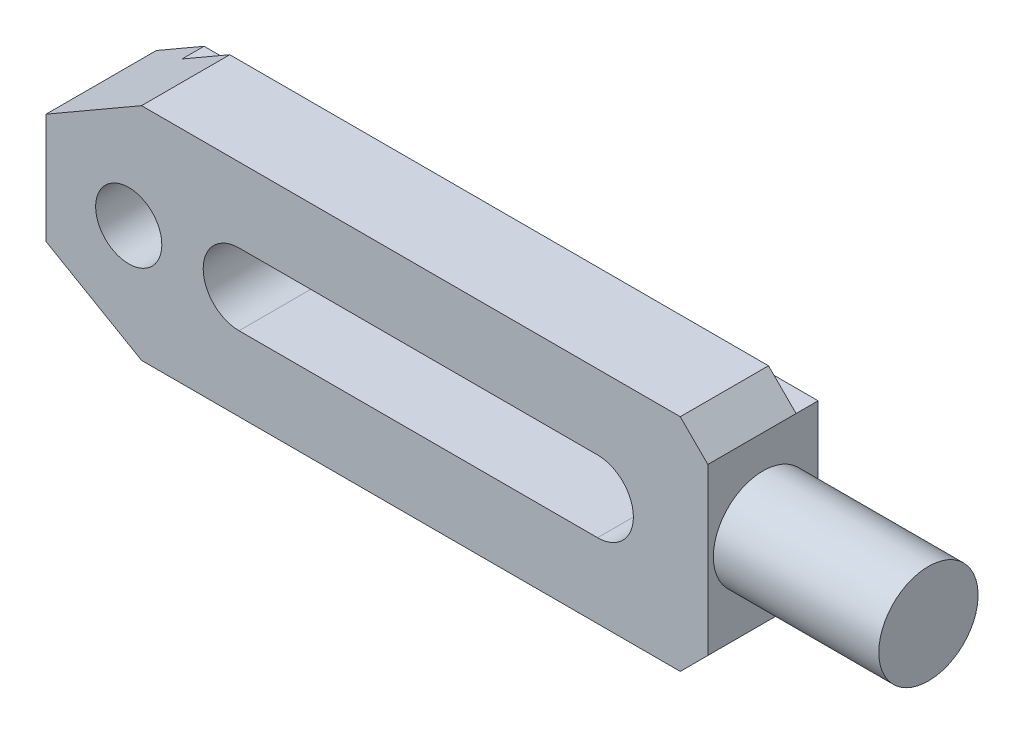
ISO-10303-21;
HEADER;
FILE_DESCRIPTION(('STEP AP214'),'2;1');
FILE_NAME('part.step','',(''),(''),'','','');
FILE_SCHEMA(('AUTOMOTIVE_DESIGN { 1 0 10303 214 1 1 1 1 }'));
ENDSEC;
DATA;
#1=APPLICATION_CONTEXT('core data for automotive mechanical design processes');
#2=APPLICATION_PROTOCOL_DEFINITION('international standard','automotive_design',2000,#1);
#3=PRODUCT_CONTEXT('',#1,'mechanical');
#4=PRODUCT('Part','Part','',(#3));
#5=PRODUCT_RELATED_PRODUCT_CATEGORY('part','',(#4));
#6=PRODUCT_DEFINITION_FORMATION('','',#4);
#7=PRODUCT_DEFINITION_CONTEXT('part definition',#1,'design');
#8=PRODUCT_DEFINITION('design','',#6,#7);
#9=PRODUCT_DEFINITION_SHAPE('','',#8);
#10=(LENGTH_UNIT() NAMED_UNIT(*) SI_UNIT(.MILLI.,.METRE.));
#11=(NAMED_UNIT(*) PLANE_ANGLE_UNIT() SI_UNIT($,.RADIAN.));
#12=(NAMED_UNIT(*) SI_UNIT($,.STERADIAN.) SOLID_ANGLE_UNIT());
#13=UNCERTAINTY_MEASURE_WITH_UNIT(LENGTH_MEASURE(1.E-05),#10,'distance_accuracy_value','');
#14=(GEOMETRIC_REPRESENTATION_CONTEXT(3) GLOBAL_UNCERTAINTY_ASSIGNED_CONTEXT((#13)) GLOBAL_UNIT_ASSIGNED_CONTEXT((#10,
#11,#12)) REPRESENTATION_CONTEXT('',''));
#15=CARTESIAN_POINT('',(0.,0.,0.));
#16=DIRECTION('',(0.,0.,1.));
#17=DIRECTION('',(1.,0.,0.));
#18=AXIS2_PLACEMENT_3D('',#15,#16,#17);
#19=CARTESIAN_POINT('',(-100.,20.,20.));
#20=DIRECTION('',(0.,0.,1.));
#21=DIRECTION('',(0.,1.,0.));
#22=AXIS2_PLACEMENT_3D('',#19,#20,#21);
#23=PLANE('',#22);
#24=CARTESIAN_POINT('',(-85.,-2.17374342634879E-13,20.));
#25=DIRECTION('',(0.,0.,1.));
#26=DIRECTION('',(0.,1.,0.));
#27=AXIS2_PLACEMENT_3D('',#24,#25,#26);
#28=CIRCLE('',#27,6.);
#29=CARTESIAN_POINT('',(-85.,5.99999999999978,20.));
#30=VERTEX_POINT('',#29);
#31=EDGE_CURVE('E158',#30,#30,#28,.T.);
#32=ORIENTED_EDGE('',*,*,#31,.F.);
#33=EDGE_LOOP('',(#32));
#34=FACE_BOUND('',#33,.T.);
#35=DIRECTION('',(1.,0.,0.));
#36=VECTOR('',#35,1.);
#37=CARTESIAN_POINT('',(-100.,20.,20.));
#38=LINE('',#37,#36);
#39=CARTESIAN_POINT('',(-82.6794919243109,20.,20.));
#40=VERTEX_POINT('',#39);
#41=CARTESIAN_POINT('',(15.,20.,20.));
#42=VERTEX_POINT('',#41);
#43=EDGE_CURVE('E234',#40,#42,#38,.T.);
#44=ORIENTED_EDGE('',*,*,#43,.F.);
#45=DIRECTION('',(0.866025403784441,0.5,0.));
#46=VECTOR('',#45,1.);
#47=CARTESIAN_POINT('',(-100.,9.99999999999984,20.));
#48=LINE('',#47,#46);
#49=CARTESIAN_POINT('',(-100.,9.99999999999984,20.));
#50=VERTEX_POINT('',#49);
#51=EDGE_CURVE('E164',#50,#40,#48,.T.);
#52=ORIENTED_EDGE('',*,*,#51,.F.);
#53=DIRECTION('',(0.,-1.,0.));
#54=VECTOR('',#53,1.);
#55=CARTESIAN_POINT('',(-100.,20.,20.));
#56=LINE('',#55,#54);
#57=CARTESIAN_POINT('',(-100.,-10.0000000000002,20.));
#58=VERTEX_POINT('',#57);
#59=EDGE_CURVE('E230',#50,#58,#56,.T.);
#60=ORIENTED_EDGE('',*,*,#59,.T.);
#61=DIRECTION('',(0.866025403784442,-0.5,0.));
#62=VECTOR('',#61,1.);
#63=CARTESIAN_POINT('',(-100.,-10.0000000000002,20.));
#64=LINE('',#63,#62);
#65=CARTESIAN_POINT('',(-82.6794919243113,-20.,20.));
#66=VERTEX_POINT('',#65);
#67=EDGE_CURVE('E179',#58,#66,#64,.T.);
#68=ORIENTED_EDGE('',*,*,#67,.T.);
#69=DIRECTION('',(1.,0.,0.));
#70=VECTOR('',#69,1.);
#71=CARTESIAN_POINT('',(-100.,-20.,20.));
#72=LINE('',#71,#70);
#73=CARTESIAN_POINT('',(15.,-20.,20.));
#74=VERTEX_POINT('',#73);
#75=EDGE_CURVE('E237',#66,#74,#72,.T.);
#76=ORIENTED_EDGE('',*,*,#75,.T.);
#77=DIRECTION('',(-0.707106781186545,-0.70710678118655,0.));
#78=VECTOR('',#77,1.);
#79=CARTESIAN_POINT('',(20.,-15.,20.));
#80=LINE('',#79,#78);
#81=CARTESIAN_POINT('',(20.,-15.,20.));
#82=VERTEX_POINT('',#81);
#83=EDGE_CURVE('E203',#82,#74,#80,.T.);
#84=ORIENTED_EDGE('',*,*,#83,.F.);
#85=DIRECTION('',(0.,-1.,0.));
#86=VECTOR('',#85,1.);
#87=CARTESIAN_POINT('',(20.,20.,20.));
#88=LINE('',#87,#86);
#89=CARTESIAN_POINT('',(20.,14.9999999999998,20.));
#90=VERTEX_POINT('',#89);
#91=EDGE_CURVE('E9',#90,#82,#88,.T.);
#92=ORIENTED_EDGE('',*,*,#91,.F.);
#93=DIRECTION('',(-0.707106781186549,0.707106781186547,0.));
#94=VECTOR('',#93,1.);
#95=CARTESIAN_POINT('',(20.,14.9999999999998,20.));
#96=LINE('',#95,#94);
#97=EDGE_CURVE('E191',#90,#42,#96,.T.);
#98=ORIENTED_EDGE('',*,*,#97,.T.);
#99=EDGE_LOOP('',(#44,#52,#60,#68,#76,#84,#92,#98));
#100=FACE_BOUND('',#99,.T.);
#101=DIRECTION('',(1.,0.,0.));
#102=VECTOR('',#101,1.);
#103=CARTESIAN_POINT('',(-65.,6.49999999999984,20.));
#104=LINE('',#103,#102);
#105=CARTESIAN_POINT('',(-65.,6.49999999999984,20.));
#106=VERTEX_POINT('',#105);
#107=CARTESIAN_POINT('',(0.,6.5,20.));
#108=VERTEX_POINT('',#107);
#109=EDGE_CURVE('E149',#106,#108,#104,.T.);
#110=ORIENTED_EDGE('',*,*,#109,.T.);
#111=CARTESIAN_POINT('',(0.,0.,20.));
#112=DIRECTION('',(0.,0.,1.));
#113=DIRECTION('',(0.,1.,0.));
#114=AXIS2_PLACEMENT_3D('',#111,#112,#113);
#115=CIRCLE('',#114,6.5);
#116=CARTESIAN_POINT('',(0.,-6.5,20.));
#117=VERTEX_POINT('',#116);
#118=EDGE_CURVE('E122',#117,#108,#115,.T.);
#119=ORIENTED_EDGE('',*,*,#118,.F.);
#120=DIRECTION('',(-1.,0.,0.));
#121=VECTOR('',#120,1.);
#122=CARTESIAN_POINT('',(0.,-6.5,20.));
#123=LINE('',#122,#121);
#124=CARTESIAN_POINT('',(-65.,-6.50000000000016,20.));
#125=VERTEX_POINT('',#124);
#126=EDGE_CURVE('E144',#117,#125,#123,.T.);
#127=ORIENTED_EDGE('',*,*,#126,.T.);
#128=CARTESIAN_POINT('',(-65.,-1.66227438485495E-13,20.));
#129=DIRECTION('',(0.,0.,1.));
#130=DIRECTION('',(0.,1.,0.));
#131=AXIS2_PLACEMENT_3D('',#128,#129,#130);
#132=CIRCLE('',#131,6.5);
#133=EDGE_CURVE('E29',#106,#125,#132,.T.);
#134=ORIENTED_EDGE('',*,*,#133,.F.);
#135=EDGE_LOOP('',(#110,#119,#127,#134));
#136=FACE_BOUND('',#135,.T.);
#137=ADVANCED_FACE('F14',(#34,#100,#136),#23,.T.);
#138=CARTESIAN_POINT('',(-100.,-15.,0.));
#139=DIRECTION('',(0.,0.,-1.));
#140=DIRECTION('',(0.,-1.,0.));
#141=AXIS2_PLACEMENT_3D('',#138,#139,#140);
#142=PLANE('',#141);
#143=CARTESIAN_POINT('',(-85.,-2.17374342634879E-13,0.));
#144=DIRECTION('',(0.,0.,1.));
#145=DIRECTION('',(0.,1.,0.));
#146=AXIS2_PLACEMENT_3D('',#143,#144,#145);
#147=CIRCLE('',#146,6.);
#148=CARTESIAN_POINT('',(-85.,5.99999999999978,0.));
#149=VERTEX_POINT('',#148);
#150=EDGE_CURVE('E126',#149,#149,#147,.T.);
#151=ORIENTED_EDGE('',*,*,#150,.T.);
#152=EDGE_LOOP('',(#151));
#153=FACE_BOUND('',#152,.T.);
#154=DIRECTION('',(0.,1.,0.));
#155=VECTOR('',#154,1.);
#156=CARTESIAN_POINT('',(-100.,-15.,0.));
#157=LINE('',#156,#155);
#158=CARTESIAN_POINT('',(-100.,-10.0000000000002,0.));
#159=VERTEX_POINT('',#158);
#160=CARTESIAN_POINT('',(-100.,9.99999999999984,0.));
#161=VERTEX_POINT('',#160);
#162=EDGE_CURVE('E231',#159,#161,#157,.T.);
#163=ORIENTED_EDGE('',*,*,#162,.T.);
#164=DIRECTION('',(0.866025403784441,0.5,0.));
#165=VECTOR('',#164,1.);
#166=CARTESIAN_POINT('',(-100.,9.99999999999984,0.));
#167=LINE('',#166,#165);
#168=CARTESIAN_POINT('',(-91.3397459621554,14.9999999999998,0.));
#169=VERTEX_POINT('',#168);
#170=EDGE_CURVE('E161',#161,#169,#167,.T.);
#171=ORIENTED_EDGE('',*,*,#170,.T.);
#172=DIRECTION('',(1.,0.,0.));
#173=VECTOR('',#172,1.);
#174=CARTESIAN_POINT('',(-100.,14.9999999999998,0.));
#175=LINE('',#174,#173);
#176=CARTESIAN_POINT('',(20.,14.9999999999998,0.));
#177=VERTEX_POINT('',#176);
#178=EDGE_CURVE('E245',#169,#177,#175,.T.);
#179=ORIENTED_EDGE('',*,*,#178,.T.);
#180=DIRECTION('',(0.,1.,0.));
#181=VECTOR('',#180,1.);
#182=CARTESIAN_POINT('',(20.,-15.,0.));
#183=LINE('',#182,#181);
#184=CARTESIAN_POINT('',(20.,-15.,0.));
#185=VERTEX_POINT('',#184);
#186=EDGE_CURVE('E224',#185,#177,#183,.T.);
#187=ORIENTED_EDGE('',*,*,#186,.F.);
#188=DIRECTION('',(1.,0.,0.));
#189=VECTOR('',#188,1.);
#190=CARTESIAN_POINT('',(-100.,-15.,0.));
#191=LINE('',#190,#189);
#192=CARTESIAN_POINT('',(-91.3397459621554,-15.,0.));
#193=VERTEX_POINT('',#192);
#194=EDGE_CURVE('E243',#193,#185,#191,.T.);
#195=ORIENTED_EDGE('',*,*,#194,.F.);
#196=DIRECTION('',(0.866025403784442,-0.5,0.));
#197=VECTOR('',#196,1.);
#198=CARTESIAN_POINT('',(-100.,-10.0000000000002,0.));
#199=LINE('',#198,#197);
#200=EDGE_CURVE('E177',#159,#193,#199,.T.);
#201=ORIENTED_EDGE('',*,*,#200,.F.);
#202=EDGE_LOOP('',(#163,#171,#179,#187,#195,#201));
#203=FACE_BOUND('',#202,.T.);
#204=DIRECTION('',(-1.,0.,0.));
#205=VECTOR('',#204,1.);
#206=CARTESIAN_POINT('',(0.,-6.5,0.));
#207=LINE('',#206,#205);
#208=CARTESIAN_POINT('',(0.,-6.5,0.));
#209=VERTEX_POINT('',#208);
#210=CARTESIAN_POINT('',(-65.,-6.50000000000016,0.));
#211=VERTEX_POINT('',#210);
#212=EDGE_CURVE('E140',#209,#211,#207,.T.);
#213=ORIENTED_EDGE('',*,*,#212,.F.);
#214=CARTESIAN_POINT('',(0.,0.,0.));
#215=DIRECTION('',(0.,0.,1.));
#216=DIRECTION('',(0.,1.,0.));
#217=AXIS2_PLACEMENT_3D('',#214,#215,#216);
#218=CIRCLE('',#217,6.5);
#219=CARTESIAN_POINT('',(0.,6.5,0.));
#220=VERTEX_POINT('',#219);
#221=EDGE_CURVE('E37',#209,#220,#218,.T.);
#222=ORIENTED_EDGE('',*,*,#221,.T.);
#223=DIRECTION('',(1.,0.,0.));
#224=VECTOR('',#223,1.);
#225=CARTESIAN_POINT('',(-65.,6.49999999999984,0.));
#226=LINE('',#225,#224);
#227=CARTESIAN_POINT('',(-65.,6.49999999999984,0.));
#228=VERTEX_POINT('',#227);
#229=EDGE_CURVE('E130',#228,#220,#226,.T.);
#230=ORIENTED_EDGE('',*,*,#229,.F.);
#231=CARTESIAN_POINT('',(-65.,-1.66227438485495E-13,0.));
#232=DIRECTION('',(0.,0.,1.));
#233=DIRECTION('',(0.,1.,0.));
#234=AXIS2_PLACEMENT_3D('',#231,#232,#233);
#235=CIRCLE('',#234,6.5);
#236=EDGE_CURVE('E135',#228,#211,#235,.T.);
#237=ORIENTED_EDGE('',*,*,#236,.T.);
#238=EDGE_LOOP('',(#213,#222,#230,#237));
#239=FACE_BOUND('',#238,.T.);
#240=ADVANCED_FACE('F138',(#153,#203,#239),#142,.T.);
#241=CARTESIAN_POINT('',(-100.,20.,4.));
#242=DIRECTION('',(0.,1.,0.));
#243=DIRECTION('',(0.,0.,-1.));
#244=AXIS2_PLACEMENT_3D('',#241,#242,#243);
#245=PLANE('',#244);
#246=DIRECTION('',(1.,0.,0.));
#247=VECTOR('',#246,1.);
#248=CARTESIAN_POINT('',(-100.,20.,4.));
#249=LINE('',#248,#247);
#250=CARTESIAN_POINT('',(-82.6794919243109,20.,4.));
#251=VERTEX_POINT('',#250);
#252=CARTESIAN_POINT('',(15.,20.,4.));
#253=VERTEX_POINT('',#252);
#254=EDGE_CURVE('E22',#251,#253,#249,.T.);
#255=ORIENTED_EDGE('',*,*,#254,.F.);
#256=DIRECTION('',(0.,0.,-1.));
#257=VECTOR('',#256,1.);
#258=CARTESIAN_POINT('',(-82.6794919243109,20.,20.));
#259=LINE('',#258,#257);
#260=EDGE_CURVE('E166',#40,#251,#259,.T.);
#261=ORIENTED_EDGE('',*,*,#260,.F.);
#262=ORIENTED_EDGE('',*,*,#43,.T.);
#263=DIRECTION('',(0.,0.,-1.));
#264=VECTOR('',#263,1.);
#265=CARTESIAN_POINT('',(15.,20.,20.));
#266=LINE('',#265,#264);
#267=EDGE_CURVE('E197',#42,#253,#266,.T.);
#268=ORIENTED_EDGE('',*,*,#267,.T.);
#269=EDGE_LOOP('',(#255,#261,#262,#268));
#270=FACE_BOUND('',#269,.T.);
#271=ADVANCED_FACE('F258',(#270),#245,.T.);
#272=CARTESIAN_POINT('',(-100.,14.9999999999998,4.));
#273=DIRECTION('',(0.,0.,-1.));
#274=DIRECTION('',(0.,-1.,0.));
#275=AXIS2_PLACEMENT_3D('',#272,#273,#274);
#276=PLANE('',#275);
#277=DIRECTION('',(1.,0.,0.));
#278=VECTOR('',#277,1.);
#279=CARTESIAN_POINT('',(-100.,14.9999999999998,4.));
#280=LINE('',#279,#278);
#281=CARTESIAN_POINT('',(-91.3397459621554,14.9999999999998,4.));
#282=VERTEX_POINT('',#281);
#283=CARTESIAN_POINT('',(20.,14.9999999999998,4.));
#284=VERTEX_POINT('',#283);
#285=EDGE_CURVE('E247',#282,#284,#280,.T.);
#286=ORIENTED_EDGE('',*,*,#285,.F.);
#287=DIRECTION('',(0.866025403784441,0.5,0.));
#288=VECTOR('',#287,1.);
#289=CARTESIAN_POINT('',(-97.834936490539,11.2499999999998,4.));
#290=LINE('',#289,#288);
#291=EDGE_CURVE('E174',#282,#251,#290,.T.);
#292=ORIENTED_EDGE('',*,*,#291,.T.);
#293=ORIENTED_EDGE('',*,*,#254,.T.);
#294=DIRECTION('',(-0.707106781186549,0.707106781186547,0.));
#295=VECTOR('',#294,1.);
#296=CARTESIAN_POINT('',(-40.,75.,4.));
#297=LINE('',#296,#295);
#298=EDGE_CURVE('E200',#284,#253,#297,.T.);
#299=ORIENTED_EDGE('',*,*,#298,.F.);
#300=EDGE_LOOP('',(#286,#292,#293,#299));
#301=FACE_BOUND('',#300,.T.);
#302=ADVANCED_FACE('F16',(#301),#276,.T.);
#303=CARTESIAN_POINT('',(-100.,14.9999999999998,0.));
#304=DIRECTION('',(0.,1.,0.));
#305=DIRECTION('',(0.,0.,-1.));
#306=AXIS2_PLACEMENT_3D('',#303,#304,#305);
#307=PLANE('',#306);
#308=ORIENTED_EDGE('',*,*,#178,.F.);
#309=DIRECTION('',(0.,0.,1.));
#310=VECTOR('',#309,1.);
#311=CARTESIAN_POINT('',(-91.3397459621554,14.9999999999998,0.));
#312=LINE('',#311,#310);
#313=EDGE_CURVE('E171',#169,#282,#312,.T.);
#314=ORIENTED_EDGE('',*,*,#313,.T.);
#315=ORIENTED_EDGE('',*,*,#285,.T.);
#316=DIRECTION('',(0.,0.,1.));
#317=VECTOR('',#316,1.);
#318=CARTESIAN_POINT('',(20.,14.9999999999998,0.));
#319=LINE('',#318,#317);
#320=EDGE_CURVE('E227',#177,#284,#319,.T.);
#321=ORIENTED_EDGE('',*,*,#320,.F.);
#322=EDGE_LOOP('',(#308,#314,#315,#321));
#323=FACE_BOUND('',#322,.T.);
#324=ADVANCED_FACE('F273',(#323),#307,.T.);
#325=CARTESIAN_POINT('',(-100.,20.,20.));
#326=DIRECTION('',(1.,0.,0.));
#327=DIRECTION('',(0.,0.,-1.));
#328=AXIS2_PLACEMENT_3D('',#325,#326,#327);
#329=PLANE('',#328);
#330=DIRECTION('',(0.,0.,-1.));
#331=VECTOR('',#330,1.);
#332=CARTESIAN_POINT('',(-100.,9.99999999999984,20.));
#333=LINE('',#332,#331);
#334=EDGE_CURVE('E168',#50,#161,#333,.T.);
#335=ORIENTED_EDGE('',*,*,#334,.T.);
#336=ORIENTED_EDGE('',*,*,#162,.F.);
#337=DIRECTION('',(0.,0.,-1.));
#338=VECTOR('',#337,1.);
#339=CARTESIAN_POINT('',(-100.,-10.0000000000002,20.));
#340=LINE('',#339,#338);
#341=EDGE_CURVE('E182',#58,#159,#340,.T.);
#342=ORIENTED_EDGE('',*,*,#341,.F.);
#343=ORIENTED_EDGE('',*,*,#59,.F.);
#344=EDGE_LOOP('',(#335,#336,#342,#343));
#345=FACE_BOUND('',#344,.T.);
#346=ADVANCED_FACE('F282',(#345),#329,.F.);
#347=CARTESIAN_POINT('',(-100.,-20.,4.));
#348=DIRECTION('',(0.,0.,-1.));
#349=DIRECTION('',(0.,-1.,0.));
#350=AXIS2_PLACEMENT_3D('',#347,#348,#349);
#351=PLANE('',#350);
#352=DIRECTION('',(0.866025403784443,-0.5,0.));
#353=VECTOR('',#352,1.);
#354=CARTESIAN_POINT('',(-95.6698729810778,-12.5000000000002,4.));
#355=LINE('',#354,#353);
#356=CARTESIAN_POINT('',(-91.3397459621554,-15.,4.));
#357=VERTEX_POINT('',#356);
#358=CARTESIAN_POINT('',(-82.6794919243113,-20.,4.));
#359=VERTEX_POINT('',#358);
#360=EDGE_CURVE('E189',#357,#359,#355,.T.);
#361=ORIENTED_EDGE('',*,*,#360,.F.);
#362=DIRECTION('',(1.,0.,0.));
#363=VECTOR('',#362,1.);
#364=CARTESIAN_POINT('',(-100.,-15.,4.));
#365=LINE('',#364,#363);
#366=CARTESIAN_POINT('',(20.,-15.,4.));
#367=VERTEX_POINT('',#366);
#368=EDGE_CURVE('E241',#357,#367,#365,.T.);
#369=ORIENTED_EDGE('',*,*,#368,.T.);
#370=DIRECTION('',(-0.707106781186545,-0.70710678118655,0.));
#371=VECTOR('',#370,1.);
#372=CARTESIAN_POINT('',(-42.5,-77.5,4.));
#373=LINE('',#372,#371);
#374=CARTESIAN_POINT('',(15.,-20.,4.));
#375=VERTEX_POINT('',#374);
#376=EDGE_CURVE('E212',#367,#375,#373,.T.);
#377=ORIENTED_EDGE('',*,*,#376,.T.);
#378=DIRECTION('',(1.,0.,0.));
#379=VECTOR('',#378,1.);
#380=CARTESIAN_POINT('',(-100.,-20.,4.));
#381=LINE('',#380,#379);
#382=EDGE_CURVE('E239',#359,#375,#381,.T.);
#383=ORIENTED_EDGE('',*,*,#382,.F.);
#384=EDGE_LOOP('',(#361,#369,#377,#383));
#385=FACE_BOUND('',#384,.T.);
#386=ADVANCED_FACE('F293',(#385),#351,.T.);
#387=CARTESIAN_POINT('',(-100.,-20.,20.));
#388=DIRECTION('',(0.,-1.,0.));
#389=DIRECTION('',(0.,0.,1.));
#390=AXIS2_PLACEMENT_3D('',#387,#388,#389);
#391=PLANE('',#390);
#392=DIRECTION('',(0.,0.,-1.));
#393=VECTOR('',#392,1.);
#394=CARTESIAN_POINT('',(-82.6794919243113,-20.,20.));
#395=LINE('',#394,#393);
#396=EDGE_CURVE('E184',#66,#359,#395,.T.);
#397=ORIENTED_EDGE('',*,*,#396,.T.);
#398=ORIENTED_EDGE('',*,*,#382,.T.);
#399=DIRECTION('',(0.,0.,-1.));
#400=VECTOR('',#399,1.);
#401=CARTESIAN_POINT('',(15.,-20.,20.));
#402=LINE('',#401,#400);
#403=EDGE_CURVE('E206',#74,#375,#402,.T.);
#404=ORIENTED_EDGE('',*,*,#403,.F.);
#405=ORIENTED_EDGE('',*,*,#75,.F.);
#406=EDGE_LOOP('',(#397,#398,#404,#405));
#407=FACE_BOUND('',#406,.T.);
#408=ADVANCED_FACE('F290',(#407),#391,.T.);
#409=CARTESIAN_POINT('',(20.,-30.,30.));
#410=DIRECTION('',(-1.,0.,0.));
#411=DIRECTION('',(0.,0.,1.));
#412=AXIS2_PLACEMENT_3D('',#409,#410,#411);
#413=PLANE('',#412);
#414=CARTESIAN_POINT('',(20.,0.,10.));
#415=DIRECTION('',(-1.,0.,0.));
#416=DIRECTION('',(0.,0.,1.));
#417=AXIS2_PLACEMENT_3D('',#414,#415,#416);
#418=CIRCLE('',#417,9.);
#419=CARTESIAN_POINT('',(20.,0.,19.));
#420=VERTEX_POINT('',#419);
#421=EDGE_CURVE('E218',#420,#420,#418,.T.);
#422=ORIENTED_EDGE('',*,*,#421,.T.);
#423=EDGE_LOOP('',(#422));
#424=FACE_BOUND('',#423,.T.);
#425=ORIENTED_EDGE('',*,*,#320,.T.);
#426=DIRECTION('',(0.,0.,-1.));
#427=VECTOR('',#426,1.);
#428=CARTESIAN_POINT('',(20.,14.9999999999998,20.));
#429=LINE('',#428,#427);
#430=EDGE_CURVE('E194',#90,#284,#429,.T.);
#431=ORIENTED_EDGE('',*,*,#430,.F.);
#432=ORIENTED_EDGE('',*,*,#91,.T.);
#433=DIRECTION('',(0.,0.,-1.));
#434=VECTOR('',#433,1.);
#435=CARTESIAN_POINT('',(20.,-15.,20.));
#436=LINE('',#435,#434);
#437=EDGE_CURVE('E209',#82,#367,#436,.T.);
#438=ORIENTED_EDGE('',*,*,#437,.T.);
#439=DIRECTION('',(0.,0.,-1.));
#440=VECTOR('',#439,1.);
#441=CARTESIAN_POINT('',(20.,-15.,4.));
#442=LINE('',#441,#440);
#443=EDGE_CURVE('E221',#367,#185,#442,.T.);
#444=ORIENTED_EDGE('',*,*,#443,.T.);
#445=ORIENTED_EDGE('',*,*,#186,.T.);
#446=EDGE_LOOP('',(#425,#431,#432,#438,#444,#445));
#447=FACE_BOUND('',#446,.T.);
#448=ADVANCED_FACE('F267',(#424,#447),#413,.F.);
#449=CARTESIAN_POINT('',(-100.,-15.,4.));
#450=DIRECTION('',(0.,-1.,0.));
#451=DIRECTION('',(0.,0.,1.));
#452=AXIS2_PLACEMENT_3D('',#449,#450,#451);
#453=PLANE('',#452);
#454=DIRECTION('',(0.,0.,1.));
#455=VECTOR('',#454,1.);
#456=CARTESIAN_POINT('',(-91.3397459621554,-15.,4.));
#457=LINE('',#456,#455);
#458=EDGE_CURVE('E187',#193,#357,#457,.T.);
#459=ORIENTED_EDGE('',*,*,#458,.F.);
#460=ORIENTED_EDGE('',*,*,#194,.T.);
#461=ORIENTED_EDGE('',*,*,#443,.F.);
#462=ORIENTED_EDGE('',*,*,#368,.F.);
#463=EDGE_LOOP('',(#459,#460,#461,#462));
#464=FACE_BOUND('',#463,.T.);
#465=ADVANCED_FACE('F301',(#464),#453,.T.);
#466=CARTESIAN_POINT('',(20.,0.,10.));
#467=DIRECTION('',(1.,0.,0.));
#468=DIRECTION('',(0.,0.,-1.));
#469=AXIS2_PLACEMENT_3D('',#466,#467,#468);
#470=CYLINDRICAL_SURFACE('',#469,9.);
#471=ORIENTED_EDGE('',*,*,#421,.F.);
#472=EDGE_LOOP('',(#471));
#473=FACE_BOUND('',#472,.T.);
#474=CARTESIAN_POINT('',(50.,1.27867260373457E-13,10.));
#475=DIRECTION('',(-1.,0.,0.));
#476=DIRECTION('',(0.,0.,1.));
#477=AXIS2_PLACEMENT_3D('',#474,#475,#476);
#478=CIRCLE('',#477,9.);
#479=CARTESIAN_POINT('',(50.,1.27867260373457E-13,19.));
#480=VERTEX_POINT('',#479);
#481=EDGE_CURVE('E215',#480,#480,#478,.T.);
#482=ORIENTED_EDGE('',*,*,#481,.T.);
#483=EDGE_LOOP('',(#482));
#484=FACE_BOUND('',#483,.T.);
#485=ADVANCED_FACE('F303',(#473,#484),#470,.T.);
#486=CARTESIAN_POINT('',(50.,20.,20.));
#487=DIRECTION('',(1.,0.,0.));
#488=DIRECTION('',(0.,0.,-1.));
#489=AXIS2_PLACEMENT_3D('',#486,#487,#488);
#490=PLANE('',#489);
#491=ORIENTED_EDGE('',*,*,#481,.F.);
#492=EDGE_LOOP('',(#491));
#493=FACE_BOUND('',#492,.T.);
#494=ADVANCED_FACE('F310',(#493),#490,.T.);
#495=CARTESIAN_POINT('',(20.,-15.,20.));
#496=DIRECTION('',(0.70710678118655,-0.707106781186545,0.));
#497=DIRECTION('',(0.707106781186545,0.70710678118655,0.));
#498=AXIS2_PLACEMENT_3D('',#495,#496,#497);
#499=PLANE('',#498);
#500=ORIENTED_EDGE('',*,*,#437,.F.);
#501=ORIENTED_EDGE('',*,*,#83,.T.);
#502=ORIENTED_EDGE('',*,*,#403,.T.);
#503=ORIENTED_EDGE('',*,*,#376,.F.);
#504=EDGE_LOOP('',(#500,#501,#502,#503));
#505=FACE_BOUND('',#504,.T.);
#506=ADVANCED_FACE('F297',(#505),#499,.T.);
#507=CARTESIAN_POINT('',(20.,14.9999999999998,20.));
#508=DIRECTION('',(-0.707106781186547,-0.707106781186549,0.));
#509=DIRECTION('',(0.707106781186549,-0.707106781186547,0.));
#510=AXIS2_PLACEMENT_3D('',#507,#508,#509);
#511=PLANE('',#510);
#512=ORIENTED_EDGE('',*,*,#298,.T.);
#513=ORIENTED_EDGE('',*,*,#267,.F.);
#514=ORIENTED_EDGE('',*,*,#97,.F.);
#515=ORIENTED_EDGE('',*,*,#430,.T.);
#516=EDGE_LOOP('',(#512,#513,#514,#515));
#517=FACE_BOUND('',#516,.T.);
#518=ADVANCED_FACE('F256',(#517),#511,.F.);
#519=CARTESIAN_POINT('',(-100.,-10.0000000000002,20.));
#520=DIRECTION('',(0.5,0.866025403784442,0.));
#521=DIRECTION('',(-0.866025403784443,0.5,0.));
#522=AXIS2_PLACEMENT_3D('',#519,#520,#521);
#523=PLANE('',#522);
#524=ORIENTED_EDGE('',*,*,#360,.T.);
#525=ORIENTED_EDGE('',*,*,#396,.F.);
#526=ORIENTED_EDGE('',*,*,#67,.F.);
#527=ORIENTED_EDGE('',*,*,#341,.T.);
#528=ORIENTED_EDGE('',*,*,#200,.T.);
#529=ORIENTED_EDGE('',*,*,#458,.T.);
#530=EDGE_LOOP('',(#524,#525,#526,#527,#528,#529));
#531=FACE_BOUND('',#530,.T.);
#532=ADVANCED_FACE('F286',(#531),#523,.F.);
#533=CARTESIAN_POINT('',(-100.,9.99999999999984,20.));
#534=DIRECTION('',(-0.5,0.866025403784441,0.));
#535=DIRECTION('',(-0.866025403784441,-0.5,0.));
#536=AXIS2_PLACEMENT_3D('',#533,#534,#535);
#537=PLANE('',#536);
#538=ORIENTED_EDGE('',*,*,#313,.F.);
#539=ORIENTED_EDGE('',*,*,#170,.F.);
#540=ORIENTED_EDGE('',*,*,#334,.F.);
#541=ORIENTED_EDGE('',*,*,#51,.T.);
#542=ORIENTED_EDGE('',*,*,#260,.T.);
#543=ORIENTED_EDGE('',*,*,#291,.F.);
#544=EDGE_LOOP('',(#538,#539,#540,#541,#542,#543));
#545=FACE_BOUND('',#544,.T.);
#546=ADVANCED_FACE('F275',(#545),#537,.T.);
#547=CARTESIAN_POINT('',(-85.,-2.17374342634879E-13,20.));
#548=DIRECTION('',(0.,0.,-1.));
#549=DIRECTION('',(0.,-1.,0.));
#550=AXIS2_PLACEMENT_3D('',#547,#548,#549);
#551=CYLINDRICAL_SURFACE('',#550,6.);
#552=ORIENTED_EDGE('',*,*,#31,.T.);
#553=EDGE_LOOP('',(#552));
#554=FACE_BOUND('',#553,.T.);
#555=ORIENTED_EDGE('',*,*,#150,.F.);
#556=EDGE_LOOP('',(#555));
#557=FACE_BOUND('',#556,.T.);
#558=ADVANCED_FACE('F348',(#554,#557),#551,.F.);
#559=CARTESIAN_POINT('',(0.,0.,20.));
#560=DIRECTION('',(0.,0.,-1.));
#561=DIRECTION('',(0.,-1.,0.));
#562=AXIS2_PLACEMENT_3D('',#559,#560,#561);
#563=CYLINDRICAL_SURFACE('',#562,6.5);
#564=DIRECTION('',(0.,0.,-1.));
#565=VECTOR('',#564,1.);
#566=CARTESIAN_POINT('',(0.,6.5,20.));
#567=LINE('',#566,#565);
#568=EDGE_CURVE('E118',#108,#220,#567,.T.);
#569=ORIENTED_EDGE('',*,*,#568,.T.);
#570=ORIENTED_EDGE('',*,*,#221,.F.);
#571=DIRECTION('',(0.,0.,-1.));
#572=VECTOR('',#571,1.);
#573=CARTESIAN_POINT('',(0.,-6.5,20.));
#574=LINE('',#573,#572);
#575=EDGE_CURVE('E147',#117,#209,#574,.T.);
#576=ORIENTED_EDGE('',*,*,#575,.F.);
#577=ORIENTED_EDGE('',*,*,#118,.T.);
#578=EDGE_LOOP('',(#569,#570,#576,#577));
#579=FACE_BOUND('',#578,.T.);
#580=ADVANCED_FACE('F120',(#579),#563,.F.);
#581=CARTESIAN_POINT('',(-65.,6.49999999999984,20.));
#582=DIRECTION('',(0.,1.,0.));
#583=DIRECTION('',(-1.,0.,0.));
#584=AXIS2_PLACEMENT_3D('',#581,#582,#583);
#585=PLANE('',#584);
#586=DIRECTION('',(0.,0.,-1.));
#587=VECTOR('',#586,1.);
#588=CARTESIAN_POINT('',(-65.,6.49999999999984,20.));
#589=LINE('',#588,#587);
#590=EDGE_CURVE('E127',#106,#228,#589,.T.);
#591=ORIENTED_EDGE('',*,*,#590,.T.);
#592=ORIENTED_EDGE('',*,*,#229,.T.);
#593=ORIENTED_EDGE('',*,*,#568,.F.);
#594=ORIENTED_EDGE('',*,*,#109,.F.);
#595=EDGE_LOOP('',(#591,#592,#593,#594));
#596=FACE_BOUND('',#595,.T.);
#597=ADVANCED_FACE('F131',(#596),#585,.F.);
#598=CARTESIAN_POINT('',(-65.,-1.66227438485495E-13,20.));
#599=DIRECTION('',(0.,0.,-1.));
#600=DIRECTION('',(0.,-1.,0.));
#601=AXIS2_PLACEMENT_3D('',#598,#599,#600);
#602=CYLINDRICAL_SURFACE('',#601,6.5);
#603=DIRECTION('',(0.,0.,-1.));
#604=VECTOR('',#603,1.);
#605=CARTESIAN_POINT('',(-65.,-6.50000000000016,20.));
#606=LINE('',#605,#604);
#607=EDGE_CURVE('E153',#125,#211,#606,.T.);
#608=ORIENTED_EDGE('',*,*,#607,.T.);
#609=ORIENTED_EDGE('',*,*,#236,.F.);
#610=ORIENTED_EDGE('',*,*,#590,.F.);
#611=ORIENTED_EDGE('',*,*,#133,.T.);
#612=EDGE_LOOP('',(#608,#609,#610,#611));
#613=FACE_BOUND('',#612,.T.);
#614=ADVANCED_FACE('F354',(#613),#602,.F.);
#615=CARTESIAN_POINT('',(0.,-6.5,20.));
#616=DIRECTION('',(0.,-1.,0.));
#617=DIRECTION('',(1.,0.,0.));
#618=AXIS2_PLACEMENT_3D('',#615,#616,#617);
#619=PLANE('',#618);
#620=ORIENTED_EDGE('',*,*,#126,.F.);
#621=ORIENTED_EDGE('',*,*,#575,.T.);
#622=ORIENTED_EDGE('',*,*,#212,.T.);
#623=ORIENTED_EDGE('',*,*,#607,.F.);
#624=EDGE_LOOP('',(#620,#621,#622,#623));
#625=FACE_BOUND('',#624,.T.);
#626=ADVANCED_FACE('F357',(#625),#619,.F.);
#627=CLOSED_SHELL('',(#137,#240,#271,#302,#324,#346,#386,#408,#448,#465,#485,#494,#506,#518,
#532,#546,#558,#580,#597,#614,#626));
#628=MANIFOLD_SOLID_BREP('B1',#627);
#629=ADVANCED_BREP_SHAPE_REPRESENTATION('',(#18,#628),#14);
#630=SHAPE_DEFINITION_REPRESENTATION(#9,#629);
ENDSEC;
END-ISO-10303-21;
